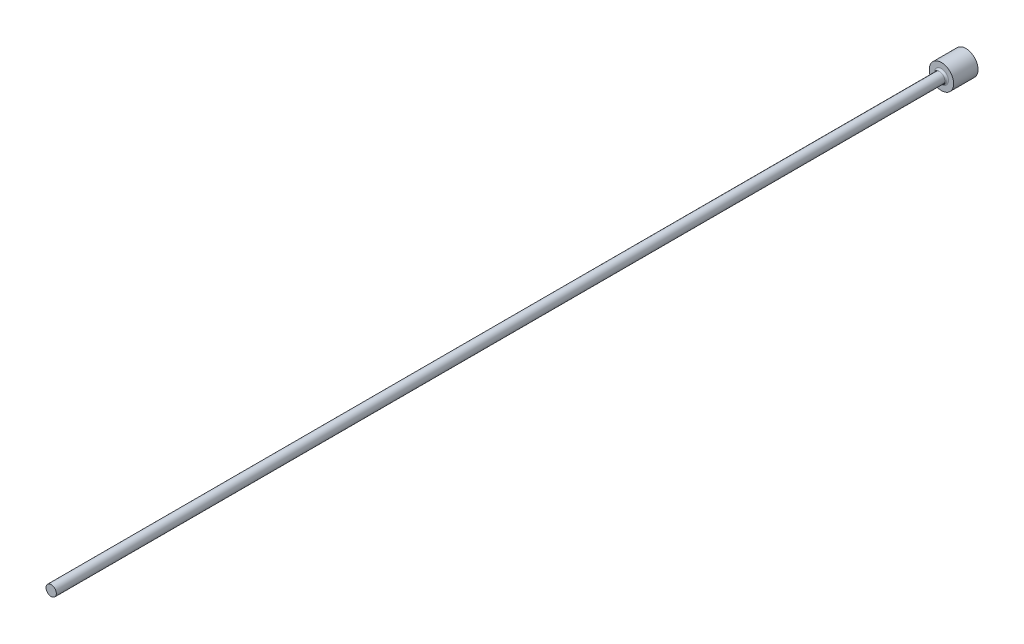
ISO-10303-21;
HEADER;
FILE_DESCRIPTION(('STEP AP214'),'2;1');
FILE_NAME('part.step','',(''),(''),'','','');
FILE_SCHEMA(('AUTOMOTIVE_DESIGN { 1 0 10303 214 1 1 1 1 }'));
ENDSEC;
DATA;
#1=APPLICATION_CONTEXT('core data for automotive mechanical design processes');
#2=APPLICATION_PROTOCOL_DEFINITION('international standard','automotive_design',2000,#1);
#3=PRODUCT_CONTEXT('',#1,'mechanical');
#4=PRODUCT('Part','Part','',(#3));
#5=PRODUCT_RELATED_PRODUCT_CATEGORY('part','',(#4));
#6=PRODUCT_DEFINITION_FORMATION('','',#4);
#7=PRODUCT_DEFINITION_CONTEXT('part definition',#1,'design');
#8=PRODUCT_DEFINITION('design','',#6,#7);
#9=PRODUCT_DEFINITION_SHAPE('','',#8);
#10=(LENGTH_UNIT() NAMED_UNIT(*) SI_UNIT(.MILLI.,.METRE.));
#11=(NAMED_UNIT(*) PLANE_ANGLE_UNIT() SI_UNIT($,.RADIAN.));
#12=(NAMED_UNIT(*) SI_UNIT($,.STERADIAN.) SOLID_ANGLE_UNIT());
#13=UNCERTAINTY_MEASURE_WITH_UNIT(LENGTH_MEASURE(1.E-05),#10,'distance_accuracy_value','');
#14=(GEOMETRIC_REPRESENTATION_CONTEXT(3) GLOBAL_UNCERTAINTY_ASSIGNED_CONTEXT((#13)) GLOBAL_UNIT_ASSIGNED_CONTEXT((#10,
#11,#12)) REPRESENTATION_CONTEXT('',''));
#15=CARTESIAN_POINT('',(0.,0.,0.));
#16=DIRECTION('',(0.,0.,1.));
#17=DIRECTION('',(1.,0.,0.));
#18=AXIS2_PLACEMENT_3D('',#15,#16,#17);
#19=CARTESIAN_POINT('',(2.,0.,4.));
#20=DIRECTION('',(0.,0.,-1.));
#21=DIRECTION('',(-1.,0.,0.));
#22=AXIS2_PLACEMENT_3D('',#19,#20,#21);
#23=PLANE('',#22);
#24=CARTESIAN_POINT('',(0.,0.,4.));
#25=DIRECTION('',(0.,0.,-1.));
#26=DIRECTION('',(-1.,0.,0.));
#27=AXIS2_PLACEMENT_3D('',#24,#25,#26);
#28=CIRCLE('',#27,1.15000000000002);
#29=CARTESIAN_POINT('',(-1.15000000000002,0.,4.));
#30=VERTEX_POINT('',#29);
#31=EDGE_CURVE('E40',#30,#30,#28,.T.);
#32=ORIENTED_EDGE('',*,*,#31,.T.);
#33=EDGE_LOOP('',(#32));
#34=FACE_BOUND('',#33,.T.);
#35=CARTESIAN_POINT('',(0.,0.,4.));
#36=DIRECTION('',(0.,0.,-1.));
#37=DIRECTION('',(-1.,0.,0.));
#38=AXIS2_PLACEMENT_3D('',#35,#36,#37);
#39=CIRCLE('',#38,2.);
#40=CARTESIAN_POINT('',(-2.,0.,4.));
#41=VERTEX_POINT('',#40);
#42=EDGE_CURVE('E44',#41,#41,#39,.T.);
#43=ORIENTED_EDGE('',*,*,#42,.F.);
#44=EDGE_LOOP('',(#43));
#45=FACE_BOUND('',#44,.T.);
#46=ADVANCED_FACE('F33',(#34,#45),#23,.F.);
#47=CARTESIAN_POINT('',(0.,0.,-9.03322817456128));
#48=DIRECTION('',(0.,0.,-1.));
#49=DIRECTION('',(-1.,0.,0.));
#50=AXIS2_PLACEMENT_3D('',#47,#48,#49);
#51=CYLINDRICAL_SURFACE('',#50,2.);
#52=CARTESIAN_POINT('',(0.,0.,0.));
#53=DIRECTION('',(0.,0.,-1.));
#54=DIRECTION('',(-1.,0.,0.));
#55=AXIS2_PLACEMENT_3D('',#52,#53,#54);
#56=CIRCLE('',#55,2.);
#57=CARTESIAN_POINT('',(-2.,0.,0.));
#58=VERTEX_POINT('',#57);
#59=EDGE_CURVE('E48',#58,#58,#56,.T.);
#60=ORIENTED_EDGE('',*,*,#59,.F.);
#61=EDGE_LOOP('',(#60));
#62=FACE_BOUND('',#61,.T.);
#63=ORIENTED_EDGE('',*,*,#42,.T.);
#64=EDGE_LOOP('',(#63));
#65=FACE_BOUND('',#64,.T.);
#66=ADVANCED_FACE('F68',(#62,#65),#51,.T.);
#67=CARTESIAN_POINT('',(0.,0.,0.));
#68=DIRECTION('',(0.,0.,1.));
#69=DIRECTION('',(1.,0.,0.));
#70=AXIS2_PLACEMENT_3D('',#67,#68,#69);
#71=PLANE('',#70);
#72=ORIENTED_EDGE('',*,*,#59,.T.);
#73=EDGE_LOOP('',(#72));
#74=FACE_BOUND('',#73,.T.);
#75=ADVANCED_FACE('F61',(#74),#71,.F.);
#76=CARTESIAN_POINT('',(0.,0.,150.));
#77=DIRECTION('',(0.,0.,-1.));
#78=DIRECTION('',(-1.,0.,0.));
#79=AXIS2_PLACEMENT_3D('',#76,#77,#78);
#80=PLANE('',#79);
#81=CARTESIAN_POINT('',(0.,0.,150.));
#82=DIRECTION('',(0.,0.,-1.));
#83=DIRECTION('',(-1.,0.,0.));
#84=AXIS2_PLACEMENT_3D('',#81,#82,#83);
#85=CIRCLE('',#84,0.85000000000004);
#86=CARTESIAN_POINT('',(-0.850000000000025,0.,150.));
#87=VERTEX_POINT('',#86);
#88=EDGE_CURVE('E53',#87,#87,#85,.T.);
#89=ORIENTED_EDGE('',*,*,#88,.F.);
#90=EDGE_LOOP('',(#89));
#91=FACE_BOUND('',#90,.T.);
#92=ADVANCED_FACE('F59',(#91),#80,.F.);
#93=CARTESIAN_POINT('',(0.,0.,-9.03322817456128));
#94=DIRECTION('',(0.,0.,-1.));
#95=DIRECTION('',(-1.,0.,0.));
#96=AXIS2_PLACEMENT_3D('',#93,#94,#95);
#97=CYLINDRICAL_SURFACE('',#96,0.85000000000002);
#98=CARTESIAN_POINT('',(0.,0.,4.3));
#99=DIRECTION('',(0.,0.,-1.));
#100=DIRECTION('',(-1.,0.,0.));
#101=AXIS2_PLACEMENT_3D('',#98,#99,#100);
#102=CIRCLE('',#101,0.85000000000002);
#103=CARTESIAN_POINT('',(-0.85000000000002,0.,4.3));
#104=VERTEX_POINT('',#103);
#105=EDGE_CURVE('E10',#104,#104,#102,.F.);
#106=ORIENTED_EDGE('',*,*,#105,.T.);
#107=EDGE_LOOP('',(#106));
#108=FACE_BOUND('',#107,.T.);
#109=ORIENTED_EDGE('',*,*,#88,.T.);
#110=EDGE_LOOP('',(#109));
#111=FACE_BOUND('',#110,.T.);
#112=ADVANCED_FACE('F57',(#108,#111),#97,.T.);
#113=CARTESIAN_POINT('',(0.,0.,4.3));
#114=DIRECTION('',(0.,0.,-1.));
#115=DIRECTION('',(-1.,0.,0.));
#116=AXIS2_PLACEMENT_3D('',#113,#114,#115);
#117=TOROIDAL_SURFACE('',#116,1.15000000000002,0.3);
#118=ORIENTED_EDGE('',*,*,#105,.F.);
#119=EDGE_LOOP('',(#118));
#120=FACE_BOUND('',#119,.T.);
#121=ORIENTED_EDGE('',*,*,#31,.F.);
#122=EDGE_LOOP('',(#121));
#123=FACE_BOUND('',#122,.T.);
#124=ADVANCED_FACE('F35',(#120,#123),#117,.F.);
#125=CLOSED_SHELL('',(#46,#66,#75,#92,#112,#124));
#126=MANIFOLD_SOLID_BREP('B2',#125);
#127=ADVANCED_BREP_SHAPE_REPRESENTATION('',(#18,#126),#14);
#128=SHAPE_DEFINITION_REPRESENTATION(#9,#127);
ENDSEC;
END-ISO-10303-21;
